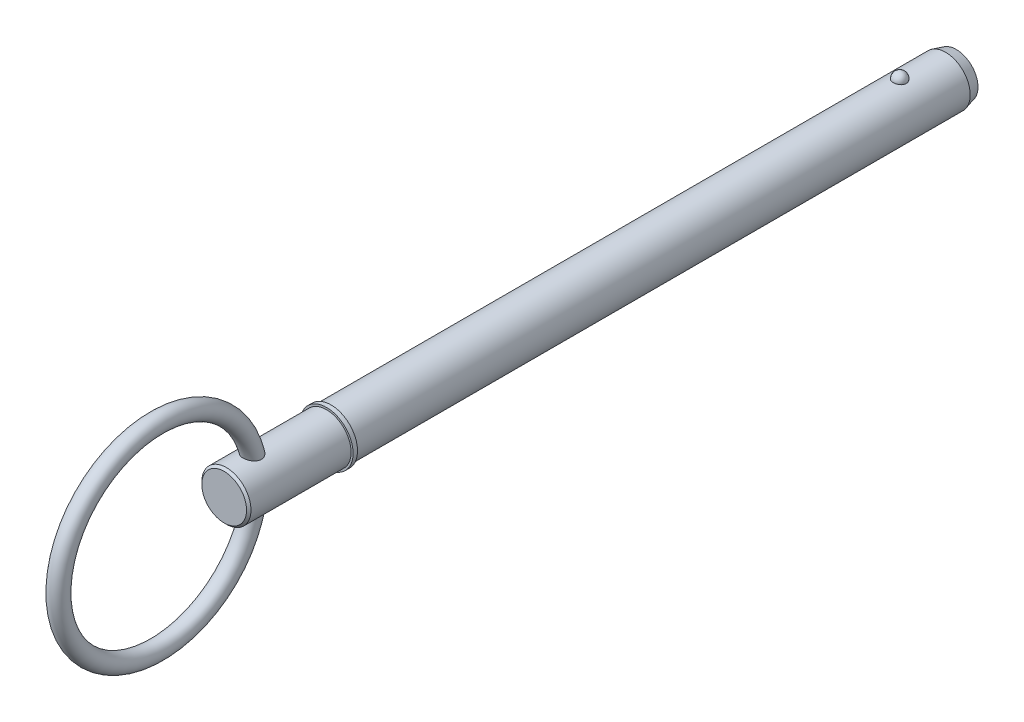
ISO-10303-21;
HEADER;
FILE_DESCRIPTION(('STEP AP214'),'2;1');
FILE_NAME('part.step','',(''),(''),'','','');
FILE_SCHEMA(('AUTOMOTIVE_DESIGN { 1 0 10303 214 1 1 1 1 }'));
ENDSEC;
DATA;
#1=APPLICATION_CONTEXT('core data for automotive mechanical design processes');
#2=APPLICATION_PROTOCOL_DEFINITION('international standard','automotive_design',2000,#1);
#3=PRODUCT_CONTEXT('',#1,'mechanical');
#4=PRODUCT('Part','Part','',(#3));
#5=PRODUCT_RELATED_PRODUCT_CATEGORY('part','',(#4));
#6=PRODUCT_DEFINITION_FORMATION('','',#4);
#7=PRODUCT_DEFINITION_CONTEXT('part definition',#1,'design');
#8=PRODUCT_DEFINITION('design','',#6,#7);
#9=PRODUCT_DEFINITION_SHAPE('','',#8);
#10=(LENGTH_UNIT() NAMED_UNIT(*) SI_UNIT(.MILLI.,.METRE.));
#11=(NAMED_UNIT(*) PLANE_ANGLE_UNIT() SI_UNIT($,.RADIAN.));
#12=(NAMED_UNIT(*) SI_UNIT($,.STERADIAN.) SOLID_ANGLE_UNIT());
#13=UNCERTAINTY_MEASURE_WITH_UNIT(LENGTH_MEASURE(1.E-05),#10,'distance_accuracy_value','');
#14=(GEOMETRIC_REPRESENTATION_CONTEXT(3) GLOBAL_UNCERTAINTY_ASSIGNED_CONTEXT((#13)) GLOBAL_UNIT_ASSIGNED_CONTEXT((#10,
#11,#12)) REPRESENTATION_CONTEXT('',''));
#15=CARTESIAN_POINT('',(0.,0.,0.));
#16=DIRECTION('',(0.,0.,1.));
#17=DIRECTION('',(1.,0.,0.));
#18=AXIS2_PLACEMENT_3D('',#15,#16,#17);
#19=CARTESIAN_POINT('',(0.,0.,127.));
#20=DIRECTION('',(0.,0.,-1.));
#21=DIRECTION('',(-1.,0.,0.));
#22=AXIS2_PLACEMENT_3D('',#19,#20,#21);
#23=CYLINDRICAL_SURFACE('',#22,5.555);
#24=CARTESIAN_POINT('',(1.47653932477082,5.35517101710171,-1.49));
#25=CARTESIAN_POINT('',(1.4765376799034,5.35517235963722,-1.40667872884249));
#26=CARTESIAN_POINT('',(1.4697233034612,5.35706459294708,-1.32333626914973));
#27=CARTESIAN_POINT('',(1.4426291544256,5.36442332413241,-1.15900769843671));
#28=CARTESIAN_POINT('',(1.42234344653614,5.36989139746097,-1.07802264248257));
#29=CARTESIAN_POINT('',(1.36882802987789,5.38378061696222,-0.920757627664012));
#30=CARTESIAN_POINT('',(1.33560404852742,5.39220045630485,-0.844475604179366));
#31=CARTESIAN_POINT('',(1.25704906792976,5.41105136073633,-0.698703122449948));
#32=CARTESIAN_POINT('',(1.21171855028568,5.42148234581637,-0.629212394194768));
#33=CARTESIAN_POINT('',(1.10986325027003,5.44324765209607,-0.498626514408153));
#34=CARTESIAN_POINT('',(1.05328868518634,5.45458585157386,-0.437570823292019));
#35=CARTESIAN_POINT('',(0.930545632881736,5.4768596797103,-0.325918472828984));
#36=CARTESIAN_POINT('',(0.864377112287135,5.48779530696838,-0.275321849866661));
#37=CARTESIAN_POINT('',(0.724412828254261,5.50801510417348,-0.186125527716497));
#38=CARTESIAN_POINT('',(0.650637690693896,5.51730356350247,-0.147494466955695));
#39=CARTESIAN_POINT('',(0.497383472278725,5.53322345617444,-0.0831582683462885));
#40=CARTESIAN_POINT('',(0.417904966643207,5.53985515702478,-0.0574518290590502));
#41=CARTESIAN_POINT('',(0.256903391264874,5.54963245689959,-0.0200294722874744));
#42=CARTESIAN_POINT('',(0.17543580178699,5.55283384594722,-0.00808940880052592));
#43=CARTESIAN_POINT('',(0.011588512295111,5.55559187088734,0.00221439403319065));
#44=CARTESIAN_POINT('',(-0.0707911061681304,5.55514883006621,0.000579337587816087));
#45=CARTESIAN_POINT('',(-0.232980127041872,5.55069756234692,-0.0161051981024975));
#46=CARTESIAN_POINT('',(-0.312809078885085,5.54673626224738,-0.0309781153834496));
#47=CARTESIAN_POINT('',(-0.468771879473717,5.5357377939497,-0.0734743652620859));
#48=CARTESIAN_POINT('',(-0.544905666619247,5.52870057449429,-0.101097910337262));
#49=CARTESIAN_POINT('',(-0.691800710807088,5.51225307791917,-0.168516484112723));
#50=CARTESIAN_POINT('',(-0.762530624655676,5.50283015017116,-0.2083766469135));
#51=CARTESIAN_POINT('',(-0.896294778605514,5.48263289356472,-0.299136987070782));
#52=CARTESIAN_POINT('',(-0.959328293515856,5.47185843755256,-0.350038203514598));
#53=CARTESIAN_POINT('',(-1.07712789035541,5.44990641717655,-0.462517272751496));
#54=CARTESIAN_POINT('',(-1.13172901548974,5.43872509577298,-0.524267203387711));
#55=CARTESIAN_POINT('',(-1.2299173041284,5.41736658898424,-0.656133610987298));
#56=CARTESIAN_POINT('',(-1.2735037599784,5.40718946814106,-0.726250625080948));
#57=CARTESIAN_POINT('',(-1.34896420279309,5.38886361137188,-0.873713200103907));
#58=CARTESIAN_POINT('',(-1.38071142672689,5.38073711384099,-0.951126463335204));
#59=CARTESIAN_POINT('',(-1.4310375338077,5.36757288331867,-1.11037033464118));
#60=CARTESIAN_POINT('',(-1.44961676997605,5.3625350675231,-1.19220082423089));
#61=CARTESIAN_POINT('',(-1.47308754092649,5.35613553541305,-1.35761209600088));
#62=CARTESIAN_POINT('',(-1.47803294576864,5.35475935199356,-1.44118467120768));
#63=CARTESIAN_POINT('',(-1.47426441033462,5.35579807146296,-1.6079958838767));
#64=CARTESIAN_POINT('',(-1.46555080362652,5.35821288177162,-1.69123452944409));
#65=CARTESIAN_POINT('',(-1.43475662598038,5.36653964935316,-1.8546288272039));
#66=CARTESIAN_POINT('',(-1.41273621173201,5.37243586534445,-1.93479663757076));
#67=CARTESIAN_POINT('',(-1.35593151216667,5.38705199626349,-2.09020110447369));
#68=CARTESIAN_POINT('',(-1.32114675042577,5.39577201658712,-2.16543757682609));
#69=CARTESIAN_POINT('',(-1.23947506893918,5.41511674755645,-2.30926926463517));
#70=CARTESIAN_POINT('',(-1.1925277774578,5.42575087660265,-2.37782893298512));
#71=CARTESIAN_POINT('',(-1.08780725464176,5.44771095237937,-2.50598876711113));
#72=CARTESIAN_POINT('',(-1.03003365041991,5.4590369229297,-2.56558862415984));
#73=CARTESIAN_POINT('',(-0.90495349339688,5.48116073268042,-2.67436535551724));
#74=CARTESIAN_POINT('',(-0.837616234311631,5.49195671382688,-2.7235073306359));
#75=CARTESIAN_POINT('',(-0.69537970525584,5.51177099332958,-2.8097317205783));
#76=CARTESIAN_POINT('',(-0.620480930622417,5.52078940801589,-2.84681492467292));
#77=CARTESIAN_POINT('',(-0.466144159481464,5.53594369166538,-2.90749751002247));
#78=CARTESIAN_POINT('',(-0.386768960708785,5.54211181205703,-2.93124844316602));
#79=CARTESIAN_POINT('',(-0.224991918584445,5.5510324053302,-2.96523308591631));
#80=CARTESIAN_POINT('',(-0.142590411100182,5.55378525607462,-2.97546829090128));
#81=CARTESIAN_POINT('',(0.0213711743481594,5.55555351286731,-2.98206550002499));
#82=CARTESIAN_POINT('',(0.102921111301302,5.55463281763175,-2.97866468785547));
#83=CARTESIAN_POINT('',(0.2642564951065,5.54929804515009,-2.95862186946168));
#84=CARTESIAN_POINT('',(0.344041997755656,5.54488407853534,-2.94198028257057));
#85=CARTESIAN_POINT('',(0.499344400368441,5.53305794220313,-2.89600357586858));
#86=CARTESIAN_POINT('',(0.574874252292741,5.52565550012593,-2.86670961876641));
#87=CARTESIAN_POINT('',(0.71989857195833,5.50863937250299,-2.79624249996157));
#88=CARTESIAN_POINT('',(0.78939269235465,5.49902555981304,-2.75506865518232));
#89=CARTESIAN_POINT('',(0.921480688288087,5.47845199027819,-2.66127110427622));
#90=CARTESIAN_POINT('',(0.983960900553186,5.46747485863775,-2.60849118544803));
#91=CARTESIAN_POINT('',(1.09925057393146,5.44546837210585,-2.49325304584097));
#92=CARTESIAN_POINT('',(1.15205830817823,5.43443900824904,-2.43079310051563));
#93=CARTESIAN_POINT('',(1.24742943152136,5.41335152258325,-2.29680711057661));
#94=CARTESIAN_POINT('',(1.28981661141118,5.40331162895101,-2.22515272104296));
#95=CARTESIAN_POINT('',(1.36214937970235,5.38553336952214,-2.07558035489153));
#96=CARTESIAN_POINT('',(1.39210034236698,5.37779400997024,-1.99766510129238));
#97=CARTESIAN_POINT('',(1.43569518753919,5.36630594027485,-1.84848338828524));
#98=CARTESIAN_POINT('',(1.45098536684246,5.36216169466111,-1.77772322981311));
#99=CARTESIAN_POINT('',(1.47140805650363,5.35659367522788,-1.63464735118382));
#100=CARTESIAN_POINT('',(1.47654075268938,5.35516985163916,-1.5623316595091));
#101=CARTESIAN_POINT('',(1.47653932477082,5.35517101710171,-1.49));
#102=B_SPLINE_CURVE_WITH_KNOTS('',3,(#24,#25,#26,#27,#28,#29,#30,#31,#32,#33,#34,#35,#36,#37,
#38,#39,#40,#41,#42,#43,#44,#45,#46,#47,#48,#49,#50,#51,#52,#53,#54,#55,#56,#57,#58,#59,#60,#61,
#62,#63,#64,#65,#66,#67,#68,#69,#70,#71,#72,#73,#74,#75,#76,#77,#78,#79,#80,#81,#82,#83,#84,#85,
#86,#87,#88,#89,#90,#91,#92,#93,#94,#95,#96,#97,#98,#99,#100,#101),.UNSPECIFIED.,.T.,.F.,(4,2,2,
2,2,2,2,2,2,2,2,2,2,2,2,2,2,2,2,2,2,2,2,2,2,2,2,2,2,2,2,2,2,2,2,2,2,2,4),(0.,0.249703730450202,
0.4995175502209,0.749220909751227,0.998914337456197,1.24973894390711,1.50056442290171,
1.75072681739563,2.00086401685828,2.24686822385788,2.49285060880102,2.73560052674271,
2.97835449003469,3.22242369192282,3.46651587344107,3.71490232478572,3.96330473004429,
4.21429522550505,4.46527899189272,4.71526963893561,4.96525418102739,5.21411697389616,
5.46298905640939,5.71312097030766,5.96326150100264,6.21422412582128,6.46517032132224,
6.71320296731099,6.96120816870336,7.20491846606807,7.44862104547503,7.69153667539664,
7.93446627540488,8.18089104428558,8.42735976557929,8.67774679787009,8.92802551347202,
9.14479867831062,9.36156787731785),.UNSPECIFIED.);
#103=CARTESIAN_POINT('',(1.47653932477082,5.35517101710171,-1.49));
#104=VERTEX_POINT('',#103);
#105=EDGE_CURVE('E103',#104,#104,#102,.T.);
#106=ORIENTED_EDGE('',*,*,#105,.T.);
#107=EDGE_LOOP('',(#106));
#108=FACE_BOUND('',#107,.T.);
#109=CARTESIAN_POINT('',(0.,0.,-11.87));
#110=DIRECTION('',(0.,0.,-1.));
#111=DIRECTION('',(-1.,0.,0.));
#112=AXIS2_PLACEMENT_3D('',#109,#110,#111);
#113=CIRCLE('',#112,5.555);
#114=CARTESIAN_POINT('',(5.555,0.,-11.87));
#115=VERTEX_POINT('',#114);
#116=EDGE_CURVE('E110',#115,#115,#113,.F.);
#117=ORIENTED_EDGE('',*,*,#116,.T.);
#118=EDGE_LOOP('',(#117));
#119=FACE_BOUND('',#118,.T.);
#120=CARTESIAN_POINT('',(0.,0.,127.));
#121=DIRECTION('',(0.,0.,1.));
#122=DIRECTION('',(1.,0.,0.));
#123=AXIS2_PLACEMENT_3D('',#120,#121,#122);
#124=CIRCLE('',#123,5.555);
#125=CARTESIAN_POINT('',(5.555,0.,127.));
#126=VERTEX_POINT('',#125);
#127=EDGE_CURVE('E108',#126,#126,#124,.T.);
#128=ORIENTED_EDGE('',*,*,#127,.F.);
#129=EDGE_LOOP('',(#128));
#130=FACE_BOUND('',#129,.T.);
#131=ADVANCED_FACE('F39',(#108,#119,#130),#23,.T.);
#132=CARTESIAN_POINT('',(0.,0.,-14.27));
#133=DIRECTION('',(0.,0.,-1.));
#134=DIRECTION('',(-1.,0.,0.));
#135=AXIS2_PLACEMENT_3D('',#132,#133,#134);
#136=PLANE('',#135);
#137=CARTESIAN_POINT('',(0.,0.,-14.27));
#138=DIRECTION('',(0.,0.,-1.));
#139=DIRECTION('',(-1.,0.,0.));
#140=AXIS2_PLACEMENT_3D('',#137,#138,#139);
#141=CIRCLE('',#140,4.9119219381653);
#142=CARTESIAN_POINT('',(4.9119219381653,0.,-14.27));
#143=VERTEX_POINT('',#142);
#144=EDGE_CURVE('E141',#143,#143,#141,.T.);
#145=ORIENTED_EDGE('',*,*,#144,.T.);
#146=EDGE_LOOP('',(#145));
#147=FACE_BOUND('',#146,.T.);
#148=ADVANCED_FACE('F89',(#147),#136,.T.);
#149=CARTESIAN_POINT('',(0.,0.,-14.27));
#150=DIRECTION('',(0.,0.,1.));
#151=DIRECTION('',(1.,0.,0.));
#152=AXIS2_PLACEMENT_3D('',#149,#150,#151);
#153=CONICAL_SURFACE('',#152,4.9119219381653,0.261799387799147);
#154=CARTESIAN_POINT('',(5.555,0.,-11.87));
#155=CARTESIAN_POINT('',(5.54830127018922,0.,-11.895));
#156=CARTESIAN_POINT('',(5.54160254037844,0.,-11.92));
#157=CARTESIAN_POINT('',(5.52820508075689,0.,-11.97));
#158=CARTESIAN_POINT('',(5.52150635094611,0.,-11.995));
#159=CARTESIAN_POINT('',(5.50810889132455,0.,-12.045));
#160=CARTESIAN_POINT('',(5.50141016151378,0.,-12.07));
#161=CARTESIAN_POINT('',(5.48801270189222,0.,-12.12));
#162=CARTESIAN_POINT('',(5.48131397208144,0.,-12.145));
#163=CARTESIAN_POINT('',(5.46791651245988,0.,-12.195));
#164=CARTESIAN_POINT('',(5.46121778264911,0.,-12.22));
#165=CARTESIAN_POINT('',(5.44782032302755,0.,-12.27));
#166=CARTESIAN_POINT('',(5.44112159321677,0.,-12.295));
#167=CARTESIAN_POINT('',(5.42772413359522,0.,-12.345));
#168=CARTESIAN_POINT('',(5.42102540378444,0.,-12.37));
#169=CARTESIAN_POINT('',(5.40762794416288,0.,-12.42));
#170=CARTESIAN_POINT('',(5.4009292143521,0.,-12.445));
#171=CARTESIAN_POINT('',(5.38753175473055,0.,-12.495));
#172=CARTESIAN_POINT('',(5.38083302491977,0.,-12.52));
#173=CARTESIAN_POINT('',(5.36743556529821,0.,-12.57));
#174=CARTESIAN_POINT('',(5.36073683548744,0.,-12.595));
#175=CARTESIAN_POINT('',(5.34733937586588,0.,-12.645));
#176=CARTESIAN_POINT('',(5.3406406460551,0.,-12.67));
#177=CARTESIAN_POINT('',(5.32724318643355,0.,-12.72));
#178=CARTESIAN_POINT('',(5.32054445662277,0.,-12.745));
#179=CARTESIAN_POINT('',(5.30714699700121,0.,-12.795));
#180=CARTESIAN_POINT('',(5.30044826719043,0.,-12.82));
#181=CARTESIAN_POINT('',(5.28705080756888,0.,-12.87));
#182=CARTESIAN_POINT('',(5.2803520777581,0.,-12.895));
#183=CARTESIAN_POINT('',(5.26695461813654,0.,-12.945));
#184=CARTESIAN_POINT('',(5.26025588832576,0.,-12.97));
#185=CARTESIAN_POINT('',(5.24685842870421,0.,-13.02));
#186=CARTESIAN_POINT('',(5.24015969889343,0.,-13.045));
#187=CARTESIAN_POINT('',(5.22676223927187,0.,-13.095));
#188=CARTESIAN_POINT('',(5.2200635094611,0.,-13.12));
#189=CARTESIAN_POINT('',(5.20666604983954,0.,-13.17));
#190=CARTESIAN_POINT('',(5.19996732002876,0.,-13.195));
#191=CARTESIAN_POINT('',(5.18656986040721,0.,-13.245));
#192=CARTESIAN_POINT('',(5.17987113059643,0.,-13.27));
#193=CARTESIAN_POINT('',(5.16647367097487,0.,-13.32));
#194=CARTESIAN_POINT('',(5.15977494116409,0.,-13.345));
#195=CARTESIAN_POINT('',(5.14637748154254,0.,-13.395));
#196=CARTESIAN_POINT('',(5.13967875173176,0.,-13.42));
#197=CARTESIAN_POINT('',(5.1262812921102,0.,-13.47));
#198=CARTESIAN_POINT('',(5.11958256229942,0.,-13.495));
#199=CARTESIAN_POINT('',(5.10618510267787,0.,-13.545));
#200=CARTESIAN_POINT('',(5.09948637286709,0.,-13.57));
#201=CARTESIAN_POINT('',(5.08608891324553,0.,-13.62));
#202=CARTESIAN_POINT('',(5.07939018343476,0.,-13.645));
#203=CARTESIAN_POINT('',(5.0659927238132,0.,-13.695));
#204=CARTESIAN_POINT('',(5.05929399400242,0.,-13.72));
#205=CARTESIAN_POINT('',(5.04589653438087,0.,-13.77));
#206=CARTESIAN_POINT('',(5.03919780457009,0.,-13.795));
#207=CARTESIAN_POINT('',(5.02580034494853,0.,-13.845));
#208=CARTESIAN_POINT('',(5.01910161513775,0.,-13.87));
#209=CARTESIAN_POINT('',(5.0057041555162,0.,-13.92));
#210=CARTESIAN_POINT('',(4.99900542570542,0.,-13.945));
#211=CARTESIAN_POINT('',(4.98560796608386,0.,-13.995));
#212=CARTESIAN_POINT('',(4.97890923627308,0.,-14.02));
#213=CARTESIAN_POINT('',(4.96551177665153,0.,-14.07));
#214=CARTESIAN_POINT('',(4.95881304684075,0.,-14.095));
#215=CARTESIAN_POINT('',(4.94541558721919,0.,-14.145));
#216=CARTESIAN_POINT('',(4.93871685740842,0.,-14.17));
#217=CARTESIAN_POINT('',(4.92531939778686,0.,-14.22));
#218=CARTESIAN_POINT('',(4.91862066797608,0.,-14.245));
#219=CARTESIAN_POINT('',(4.9119219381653,0.,-14.27));
#220=B_SPLINE_CURVE_WITH_KNOTS('',3,(#154,#155,#156,#157,#158,#159,#160,#161,#162,#163,#164,
#165,#166,#167,#168,#169,#170,#171,#172,#173,#174,#175,#176,#177,#178,#179,#180,#181,#182,#183,
#184,#185,#186,#187,#188,#189,#190,#191,#192,#193,#194,#195,#196,#197,#198,#199,#200,#201,#202,
#203,#204,#205,#206,#207,#208,#209,#210,#211,#212,#213,#214,#215,#216,#217,#218,#219),
.UNSPECIFIED.,.F.,.F.,(4,2,2,2,2,2,2,2,2,2,2,2,2,2,2,2,2,2,2,2,2,2,2,2,2,2,2,2,2,2,2,2,4),(0.,
0.0776457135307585,0.155291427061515,0.232937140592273,0.31058285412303,0.388228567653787,
0.465874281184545,0.543519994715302,0.621165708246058,0.698811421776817,0.776457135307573,
0.854102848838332,0.931748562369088,1.00939427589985,1.0870399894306,1.16468570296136,
1.24233141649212,1.31997713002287,1.39762284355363,1.47526855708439,1.55291427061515,
1.6305599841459,1.70820569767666,1.78585141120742,1.86349712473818,1.94114283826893,
2.01878855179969,2.09643426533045,2.17407997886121,2.25172569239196,2.32937140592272,
2.40701711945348,2.48466283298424),.UNSPECIFIED.);
#221=EDGE_CURVE('BSEAM95',#115,#143,#220,.T.);
#222=ORIENTED_EDGE('',*,*,#116,.F.);
#223=ORIENTED_EDGE('',*,*,#144,.F.);
#224=ORIENTED_EDGE('',*,*,#221,.T.);
#225=ORIENTED_EDGE('',*,*,#221,.F.);
#226=EDGE_LOOP('',(#222,#224,#223,#225));
#227=FACE_BOUND('',#226,.T.);
#228=ADVANCED_FACE('F95',(#227),#153,.T.);
#229=CARTESIAN_POINT('',(0.,5.555,-1.49));
#230=DIRECTION('',(0.,1.,0.));
#231=DIRECTION('',(0.,0.,-1.));
#232=AXIS2_PLACEMENT_3D('',#229,#230,#231);
#233=SPHERICAL_SURFACE('',#232,1.49);
#234=ORIENTED_EDGE('',*,*,#105,.F.);
#235=EDGE_LOOP('',(#234));
#236=FACE_BOUND('',#235,.T.);
#237=ADVANCED_FACE('F113',(#236),#233,.T.);
#238=CARTESIAN_POINT('',(0.,0.,127.));
#239=DIRECTION('',(0.,0.,-1.));
#240=DIRECTION('',(-1.,0.,0.));
#241=AXIS2_PLACEMENT_3D('',#238,#239,#240);
#242=PLANE('',#241);
#243=ORIENTED_EDGE('',*,*,#127,.T.);
#244=EDGE_LOOP('',(#243));
#245=FACE_BOUND('',#244,.T.);
#246=CARTESIAN_POINT('',(0.,0.,127.));
#247=DIRECTION('',(0.,0.,-1.));
#248=DIRECTION('',(-1.,0.,0.));
#249=AXIS2_PLACEMENT_3D('',#246,#247,#248);
#250=CIRCLE('',#249,6.);
#251=CARTESIAN_POINT('',(-6.,0.,127.));
#252=VERTEX_POINT('',#251);
#253=EDGE_CURVE('E109',#252,#252,#250,.T.);
#254=ORIENTED_EDGE('',*,*,#253,.T.);
#255=EDGE_LOOP('',(#254));
#256=FACE_BOUND('',#255,.T.);
#257=ADVANCED_FACE('F117',(#245,#256),#242,.T.);
#258=CARTESIAN_POINT('',(0.,0.,33.7287874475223));
#259=DIRECTION('',(0.,0.,-1.));
#260=DIRECTION('',(-1.,0.,0.));
#261=AXIS2_PLACEMENT_3D('',#258,#259,#260);
#262=CYLINDRICAL_SURFACE('',#261,6.);
#263=CARTESIAN_POINT('',(0.,0.,128.));
#264=DIRECTION('',(0.,0.,-1.));
#265=DIRECTION('',(-1.,0.,0.));
#266=AXIS2_PLACEMENT_3D('',#263,#264,#265);
#267=CIRCLE('',#266,6.);
#268=CARTESIAN_POINT('',(-6.,0.,128.));
#269=VERTEX_POINT('',#268);
#270=EDGE_CURVE('E134',#269,#269,#267,.T.);
#271=ORIENTED_EDGE('',*,*,#270,.T.);
#272=EDGE_LOOP('',(#271));
#273=FACE_BOUND('',#272,.T.);
#274=ORIENTED_EDGE('',*,*,#253,.F.);
#275=EDGE_LOOP('',(#274));
#276=FACE_BOUND('',#275,.T.);
#277=ADVANCED_FACE('F121',(#273,#276),#262,.T.);
#278=CARTESIAN_POINT('',(0.,6.,128.));
#279=DIRECTION('',(0.,0.,1.));
#280=DIRECTION('',(1.,0.,0.));
#281=AXIS2_PLACEMENT_3D('',#278,#279,#280);
#282=PLANE('',#281);
#283=CARTESIAN_POINT('',(0.,0.,128.));
#284=DIRECTION('',(0.,0.,1.));
#285=DIRECTION('',(1.,0.,0.));
#286=AXIS2_PLACEMENT_3D('',#283,#284,#285);
#287=CIRCLE('',#286,5.555);
#288=CARTESIAN_POINT('',(5.555,0.,128.));
#289=VERTEX_POINT('',#288);
#290=EDGE_CURVE('E112',#289,#289,#287,.T.);
#291=ORIENTED_EDGE('',*,*,#290,.F.);
#292=EDGE_LOOP('',(#291));
#293=FACE_BOUND('',#292,.T.);
#294=ORIENTED_EDGE('',*,*,#270,.F.);
#295=EDGE_LOOP('',(#294));
#296=FACE_BOUND('',#295,.T.);
#297=ADVANCED_FACE('F86',(#293,#296),#282,.T.);
#298=CARTESIAN_POINT('',(0.,0.,151.13));
#299=DIRECTION('',(0.,0.,-1.));
#300=DIRECTION('',(-1.,0.,0.));
#301=AXIS2_PLACEMENT_3D('',#298,#299,#300);
#302=CYLINDRICAL_SURFACE('',#301,5.555);
#303=CARTESIAN_POINT('',(-0.961380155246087,-5.47117658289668,143.008733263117));
#304=CARTESIAN_POINT('',(-0.863231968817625,-5.4884217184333,142.957515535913));
#305=CARTESIAN_POINT('',(-0.760548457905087,-5.50372118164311,142.914318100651));
#306=CARTESIAN_POINT('',(-0.548956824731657,-5.52883500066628,142.844912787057));
#307=CARTESIAN_POINT('',(-0.440048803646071,-5.53864944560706,142.818704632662));
#308=CARTESIAN_POINT('',(-0.219033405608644,-5.55178384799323,142.783864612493));
#309=CARTESIAN_POINT('',(-0.106925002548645,-5.55510169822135,142.775238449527));
#310=CARTESIAN_POINT('',(0.11723899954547,-5.55489351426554,142.775783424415));
#311=CARTESIAN_POINT('',(0.229294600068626,-5.55136768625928,142.784954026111));
#312=CARTESIAN_POINT('',(0.449588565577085,-5.5378711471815,142.820784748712));
#313=CARTESIAN_POINT('',(0.557843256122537,-5.52793284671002,142.847356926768));
#314=CARTESIAN_POINT('',(0.768116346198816,-5.50265785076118,142.917309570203));
#315=CARTESIAN_POINT('',(0.87013418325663,-5.48732066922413,142.960691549));
#316=CARTESIAN_POINT('',(1.06580880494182,-5.45270790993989,143.063685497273));
#317=CARTESIAN_POINT('',(1.15940337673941,-5.43340601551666,143.123406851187));
#318=CARTESIAN_POINT('',(1.33484934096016,-5.39298781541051,143.257672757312));
#319=CARTESIAN_POINT('',(1.41670019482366,-5.37187142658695,143.332217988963));
#320=CARTESIAN_POINT('',(1.56628651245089,-5.33017932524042,143.494433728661));
#321=CARTESIAN_POINT('',(1.63402728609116,-5.30960341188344,143.582099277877));
#322=CARTESIAN_POINT('',(1.75338323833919,-5.27139606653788,143.76835593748));
#323=CARTESIAN_POINT('',(1.80500413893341,-5.25376359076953,143.866943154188));
#324=CARTESIAN_POINT('',(1.88923054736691,-5.22405733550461,144.068866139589));
#325=CARTESIAN_POINT('',(1.92240068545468,-5.21182119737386,144.171942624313));
#326=CARTESIAN_POINT('',(1.97156802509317,-5.19342304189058,144.382612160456));
#327=CARTESIAN_POINT('',(1.98756752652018,-5.18726021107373,144.490204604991));
#328=CARTESIAN_POINT('',(2.00238957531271,-5.1815556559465,144.704813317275));
#329=CARTESIAN_POINT('',(2.0015062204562,-5.18190056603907,144.811807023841));
#330=CARTESIAN_POINT('',(1.98404322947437,-5.18861029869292,145.024294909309));
#331=CARTESIAN_POINT('',(1.96745884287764,-5.19497694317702,145.12978862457));
#332=CARTESIAN_POINT('',(1.91810947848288,-5.21340722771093,145.343734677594));
#333=CARTESIAN_POINT('',(1.88435438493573,-5.22581720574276,145.451927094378));
#334=CARTESIAN_POINT('',(1.80161540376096,-5.25491400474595,145.661718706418));
#335=CARTESIAN_POINT('',(1.7526231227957,-5.27160318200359,145.763314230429));
#336=CARTESIAN_POINT('',(1.63431251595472,-5.30955034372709,145.968856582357));
#337=CARTESIAN_POINT('',(1.5633341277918,-5.33111051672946,146.071796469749));
#338=CARTESIAN_POINT('',(1.4052960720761,-5.37493145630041,146.26447165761));
#339=CARTESIAN_POINT('',(1.31822569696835,-5.39719268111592,146.354198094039));
#340=CARTESIAN_POINT('',(1.12728892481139,-5.44031451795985,146.519004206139));
#341=CARTESIAN_POINT('',(1.02309899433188,-5.46113424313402,146.593723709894));
#342=CARTESIAN_POINT('',(0.801576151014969,-5.49800171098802,146.721805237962));
#343=CARTESIAN_POINT('',(0.684264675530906,-5.51405708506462,146.775201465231));
#344=CARTESIAN_POINT('',(0.45687763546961,-5.53719478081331,146.850980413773));
#345=CARTESIAN_POINT('',(0.34797457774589,-5.54519800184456,146.876584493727));
#346=CARTESIAN_POINT('',(0.127042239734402,-5.55464249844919,146.906731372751));
#347=CARTESIAN_POINT('',(0.0150164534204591,-5.55609083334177,146.911296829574));
#348=CARTESIAN_POINT('',(-0.19199318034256,-5.55250986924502,146.899911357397));
#349=CARTESIAN_POINT('',(-0.287160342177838,-5.54836194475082,146.886752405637));
#350=CARTESIAN_POINT('',(-0.473863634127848,-5.53554271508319,146.845489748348));
#351=CARTESIAN_POINT('',(-0.565399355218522,-5.52687090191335,146.817384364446));
#352=CARTESIAN_POINT('',(-0.743786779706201,-5.50572322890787,146.747293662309));
#353=CARTESIAN_POINT('',(-0.830566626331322,-5.49320168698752,146.705141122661));
#354=CARTESIAN_POINT('',(-0.996720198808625,-5.46549909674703,146.608875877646));
#355=CARTESIAN_POINT('',(-1.07609119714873,-5.45031707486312,146.554758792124));
#356=CARTESIAN_POINT('',(-1.23672272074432,-5.41628785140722,146.428211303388));
#357=CARTESIAN_POINT('',(-1.3167603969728,-5.39722327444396,146.35428911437));
#358=CARTESIAN_POINT('',(-1.46504263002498,-5.3588760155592,146.195462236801));
#359=CARTESIAN_POINT('',(-1.5332782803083,-5.33959318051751,146.110549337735));
#360=CARTESIAN_POINT('',(-1.66602271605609,-5.29979878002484,145.918697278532));
#361=CARTESIAN_POINT('',(-1.72857256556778,-5.27951148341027,145.810347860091));
#362=CARTESIAN_POINT('',(-1.83559571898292,-5.24326402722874,145.584325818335));
#363=CARTESIAN_POINT('',(-1.88006296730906,-5.22730531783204,145.466650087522));
#364=CARTESIAN_POINT('',(-1.94988009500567,-5.20167534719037,145.222087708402));
#365=CARTESIAN_POINT('',(-1.97477410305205,-5.19215470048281,145.09505279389));
#366=CARTESIAN_POINT('',(-2.00168294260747,-5.18184594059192,144.838249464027));
#367=CARTESIAN_POINT('',(-2.00372217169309,-5.18104851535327,144.70848411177));
#368=CARTESIAN_POINT('',(-1.98467753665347,-5.18836681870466,144.464652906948));
#369=CARTESIAN_POINT('',(-1.96600067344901,-5.19555485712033,144.350370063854));
#370=CARTESIAN_POINT('',(-1.90923541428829,-5.21668050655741,144.127389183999));
#371=CARTESIAN_POINT('',(-1.87115335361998,-5.23061591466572,144.018689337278));
#372=CARTESIAN_POINT('',(-1.78015350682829,-5.26224244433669,143.818371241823));
#373=CARTESIAN_POINT('',(-1.72857344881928,-5.27957041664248,143.72608293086));
#374=CARTESIAN_POINT('',(-1.61106729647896,-5.31660340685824,143.551684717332));
#375=CARTESIAN_POINT('',(-1.54514024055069,-5.33630858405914,143.469575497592));
#376=CARTESIAN_POINT('',(-1.39929408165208,-5.37641320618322,143.315887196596));
#377=CARTESIAN_POINT('',(-1.31912544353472,-5.39681868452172,143.244546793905));
#378=CARTESIAN_POINT('',(-1.14786008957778,-5.43582099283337,143.115855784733));
#379=CARTESIAN_POINT('',(-1.05676174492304,-5.4544175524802,143.058507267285));
#380=CARTESIAN_POINT('',(-0.961380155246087,-5.47117658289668,143.008733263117));
#381=B_SPLINE_CURVE_WITH_KNOTS('',3,(#303,#304,#305,#306,#307,#308,#309,#310,#311,#312,#313,
#314,#315,#316,#317,#318,#319,#320,#321,#322,#323,#324,#325,#326,#327,#328,#329,#330,#331,#332,
#333,#334,#335,#336,#337,#338,#339,#340,#341,#342,#343,#344,#345,#346,#347,#348,#349,#350,#351,
#352,#353,#354,#355,#356,#357,#358,#359,#360,#361,#362,#363,#364,#365,#366,#367,#368,#369,#370,
#371,#372,#373,#374,#375,#376,#377,#378,#379,#380),.UNSPECIFIED.,.T.,.F.,(4,2,2,2,2,2,2,2,2,2,2,
2,2,2,2,2,2,2,2,2,2,2,2,2,2,2,2,2,2,2,2,2,2,2,2,2,2,2,4),(0.,0.335747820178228,
0.671490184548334,1.00734143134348,1.34318256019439,1.67733940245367,2.01152633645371,
2.34800767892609,2.6845044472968,3.02087435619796,3.35712472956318,3.68242216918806,
4.00767603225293,4.32726924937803,4.6469591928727,4.98762165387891,5.32847210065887,
5.7074287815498,6.08663853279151,6.47407889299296,6.86089527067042,7.19531213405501,
7.52936875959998,7.81649827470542,8.10366003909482,8.39437023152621,8.68518702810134,
9.01572837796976,9.34651809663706,9.72504519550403,10.1036989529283,10.4909301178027,
10.8777478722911,11.2239231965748,11.5699855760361,11.8899109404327,12.2098577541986,
12.5360928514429,12.8623766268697),.UNSPECIFIED.);
#382=CARTESIAN_POINT('',(-0.961380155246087,-5.47117658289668,143.008733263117));
#383=VERTEX_POINT('',#382);
#384=EDGE_CURVE('E10',#383,#383,#381,.T.);
#385=ORIENTED_EDGE('',*,*,#384,.F.);
#386=EDGE_LOOP('',(#385));
#387=FACE_BOUND('',#386,.T.);
#388=CARTESIAN_POINT('',(-0.961380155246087,5.47117658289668,143.008733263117));
#389=CARTESIAN_POINT('',(-1.05891474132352,5.45403910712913,143.059631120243));
#390=CARTESIAN_POINT('',(-1.15197270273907,5.43497920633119,143.118451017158));
#391=CARTESIAN_POINT('',(-1.32661268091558,5.39501222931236,143.25070162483));
#392=CARTESIAN_POINT('',(-1.40819495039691,5.37410519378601,143.324132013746));
#393=CARTESIAN_POINT('',(-1.55769110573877,5.33269731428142,143.484098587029));
#394=CARTESIAN_POINT('',(-1.62558729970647,5.31219702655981,143.570651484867));
#395=CARTESIAN_POINT('',(-1.74556031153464,5.2739951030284,143.754646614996));
#396=CARTESIAN_POINT('',(-1.7976419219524,5.25629262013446,143.852085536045));
#397=CARTESIAN_POINT('',(-1.88339939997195,5.22617061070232,144.052565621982));
#398=CARTESIAN_POINT('',(-1.91750373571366,5.21362983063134,144.155405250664));
#399=CARTESIAN_POINT('',(-1.96852412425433,5.194582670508,144.365778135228));
#400=CARTESIAN_POINT('',(-1.98544249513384,5.18807547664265,144.473310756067));
#401=CARTESIAN_POINT('',(-2.00201964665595,5.18170011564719,144.687819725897));
#402=CARTESIAN_POINT('',(-2.00199605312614,5.18170977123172,144.794768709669));
#403=CARTESIAN_POINT('',(-1.98621575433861,5.18777751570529,145.007306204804));
#404=CARTESIAN_POINT('',(-1.97045441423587,5.19383738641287,145.112894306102));
#405=CARTESIAN_POINT('',(-1.92280904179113,5.21167084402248,145.326914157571));
#406=CARTESIAN_POINT('',(-1.88996782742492,5.22378174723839,145.435103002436));
#407=CARTESIAN_POINT('',(-1.80906901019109,5.25234475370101,145.645029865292));
#408=CARTESIAN_POINT('',(-1.76100319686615,5.26879919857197,145.746764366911));
#409=CARTESIAN_POINT('',(-1.64464870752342,5.30634509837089,145.952788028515));
#410=CARTESIAN_POINT('',(-1.57469702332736,5.32774959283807,146.056085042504));
#411=CARTESIAN_POINT('',(-1.41872356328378,5.37138743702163,146.249688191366));
#412=CARTESIAN_POINT('',(-1.3326906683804,5.39362135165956,146.339985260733));
#413=CARTESIAN_POINT('',(-1.14345202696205,5.43692909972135,146.506557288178));
#414=CARTESIAN_POINT('',(-1.03986000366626,5.45795811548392,146.582409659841));
#415=CARTESIAN_POINT('',(-0.819338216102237,5.49537389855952,146.712916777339));
#416=CARTESIAN_POINT('',(-0.702429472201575,5.51176784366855,146.767604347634));
#417=CARTESIAN_POINT('',(-0.475167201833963,5.53565843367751,146.84602203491));
#418=CARTESIAN_POINT('',(-0.365997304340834,5.5440461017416,146.872893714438));
#419=CARTESIAN_POINT('',(-0.144272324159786,5.55422966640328,146.905426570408));
#420=CARTESIAN_POINT('',(-0.0317212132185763,5.55603301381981,146.911111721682));
#421=CARTESIAN_POINT('',(0.176166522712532,5.55303883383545,146.901592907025));
#422=CARTESIAN_POINT('',(0.271662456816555,5.54914868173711,146.889260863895));
#423=CARTESIAN_POINT('',(0.45914083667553,5.53678955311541,146.849523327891));
#424=CARTESIAN_POINT('',(0.5511229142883,5.52832009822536,146.822116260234));
#425=CARTESIAN_POINT('',(0.730082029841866,5.50755841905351,146.753437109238));
#426=CARTESIAN_POINT('',(0.817013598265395,5.49523641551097,146.712056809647));
#427=CARTESIAN_POINT('',(0.983569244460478,5.46788364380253,146.617293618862));
#428=CARTESIAN_POINT('',(1.0631907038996,5.45285191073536,146.563906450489));
#429=CARTESIAN_POINT('',(1.22430017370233,5.4191117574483,146.438982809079));
#430=CARTESIAN_POINT('',(1.30459540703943,5.40018081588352,146.365970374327));
#431=CARTESIAN_POINT('',(1.45353150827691,5.3620139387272,146.208943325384));
#432=CARTESIAN_POINT('',(1.52216366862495,5.3427777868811,146.124920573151));
#433=CARTESIAN_POINT('',(1.65601602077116,5.30294271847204,145.934811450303));
#434=CARTESIAN_POINT('',(1.71927851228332,5.28255425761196,145.827294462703));
#435=CARTESIAN_POINT('',(1.82790996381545,5.24595721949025,145.602847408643));
#436=CARTESIAN_POINT('',(1.8732722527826,5.22975020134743,145.485913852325));
#437=CARTESIAN_POINT('',(1.94526503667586,5.20341207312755,145.242194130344));
#438=CARTESIAN_POINT('',(1.97135787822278,5.1934564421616,145.11522738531));
#439=CARTESIAN_POINT('',(2.00068973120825,5.18223330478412,144.858318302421));
#440=CARTESIAN_POINT('',(2.00395290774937,5.18095661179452,144.728379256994));
#441=CARTESIAN_POINT('',(1.98717985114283,5.1874070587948,144.483763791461));
#442=CARTESIAN_POINT('',(1.96951989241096,5.19421607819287,144.368899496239));
#443=CARTESIAN_POINT('',(1.91463360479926,5.2146960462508,144.144589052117));
#444=CARTESIAN_POINT('',(1.87741409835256,5.22836460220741,144.035141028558));
#445=CARTESIAN_POINT('',(1.78800305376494,5.25957304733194,143.833542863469));
#446=CARTESIAN_POINT('',(1.73720600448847,5.27672774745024,143.740709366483));
#447=CARTESIAN_POINT('',(1.62116201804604,5.3135255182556,143.565121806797));
#448=CARTESIAN_POINT('',(1.55591428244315,5.33316872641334,143.482368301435));
#449=CARTESIAN_POINT('',(1.41164041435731,5.37317145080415,143.327648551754));
#450=CARTESIAN_POINT('',(1.3324195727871,5.39353732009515,143.255865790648));
#451=CARTESIAN_POINT('',(1.16300716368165,5.43258596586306,143.126112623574));
#452=CARTESIAN_POINT('',(1.07281393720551,5.45126848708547,143.068144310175));
#453=CARTESIAN_POINT('',(0.880638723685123,5.48564753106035,142.965507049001));
#454=CARTESIAN_POINT('',(0.778364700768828,5.50122427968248,142.921343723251));
#455=CARTESIAN_POINT('',(0.567418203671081,5.52696543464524,142.849973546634));
#456=CARTESIAN_POINT('',(0.458745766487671,5.53712987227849,142.822766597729));
#457=CARTESIAN_POINT('',(0.237791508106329,5.55101406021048,142.785879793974));
#458=CARTESIAN_POINT('',(0.125501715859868,5.55471842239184,142.77624178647));
#459=CARTESIAN_POINT('',(-0.0992056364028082,5.55525045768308,142.774849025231));
#460=CARTESIAN_POINT('',(-0.211623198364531,5.55207802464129,142.783094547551));
#461=CARTESIAN_POINT('',(-0.434217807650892,5.53913427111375,142.817408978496));
#462=CARTESIAN_POINT('',(-0.544370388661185,5.5293114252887,142.843617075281));
#463=CARTESIAN_POINT('',(-0.758352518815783,5.50404767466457,142.913395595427));
#464=CARTESIAN_POINT('',(-0.862181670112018,5.48860641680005,142.956967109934));
#465=CARTESIAN_POINT('',(-0.961380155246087,5.47117658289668,143.008733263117));
#466=B_SPLINE_CURVE_WITH_KNOTS('',3,(#388,#389,#390,#391,#392,#393,#394,#395,#396,#397,#398,
#399,#400,#401,#402,#403,#404,#405,#406,#407,#408,#409,#410,#411,#412,#413,#414,#415,#416,#417,
#418,#419,#420,#421,#422,#423,#424,#425,#426,#427,#428,#429,#430,#431,#432,#433,#434,#435,#436,
#437,#438,#439,#440,#441,#442,#443,#444,#445,#446,#447,#448,#449,#450,#451,#452,#453,#454,#455,
#456,#457,#458,#459,#460,#461,#462,#463,#464,#465),.UNSPECIFIED.,.T.,.F.,(4,2,2,2,2,2,2,2,2,2,2,
2,2,2,2,2,2,2,2,2,2,2,2,2,2,2,2,2,2,2,2,2,2,2,2,2,2,2,4),(0.,0.333636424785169,
0.667265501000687,1.00132312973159,1.3352794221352,1.6608682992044,1.98641325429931,
2.30585509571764,2.62539104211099,2.96514840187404,3.3050893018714,3.68313901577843,
4.06145109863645,4.44953802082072,4.83702062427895,5.17316628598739,5.50893144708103,
5.79666415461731,6.08442692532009,6.3744714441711,6.66461944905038,6.99384361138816,
7.32331250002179,7.70083591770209,8.07849989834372,8.46633986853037,8.85376924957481,
9.20110411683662,9.54831791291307,9.86844524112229,10.1885902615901,10.5136110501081,
10.8386810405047,11.1745469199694,11.5104108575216,11.847073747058,12.183741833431,
12.5230486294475,12.8623767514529),.UNSPECIFIED.);
#467=CARTESIAN_POINT('',(-0.961380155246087,5.47117658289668,143.008733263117));
#468=VERTEX_POINT('',#467);
#469=EDGE_CURVE('E51',#468,#468,#466,.T.);
#470=ORIENTED_EDGE('',*,*,#469,.F.);
#471=EDGE_LOOP('',(#470));
#472=FACE_BOUND('',#471,.T.);
#473=CARTESIAN_POINT('',(0.,0.,150.63));
#474=DIRECTION('',(0.,0.,-1.));
#475=DIRECTION('',(-1.,0.,0.));
#476=AXIS2_PLACEMENT_3D('',#473,#474,#475);
#477=CIRCLE('',#476,5.555);
#478=CARTESIAN_POINT('',(-5.555,0.,150.63));
#479=VERTEX_POINT('',#478);
#480=EDGE_CURVE('E65',#479,#479,#477,.T.);
#481=ORIENTED_EDGE('',*,*,#480,.T.);
#482=EDGE_LOOP('',(#481));
#483=FACE_BOUND('',#482,.T.);
#484=ORIENTED_EDGE('',*,*,#290,.T.);
#485=EDGE_LOOP('',(#484));
#486=FACE_BOUND('',#485,.T.);
#487=ADVANCED_FACE('F70',(#387,#472,#483,#486),#302,.T.);
#488=CARTESIAN_POINT('',(0.,0.,151.13));
#489=DIRECTION('',(0.,0.,-1.));
#490=DIRECTION('',(-1.,0.,0.));
#491=AXIS2_PLACEMENT_3D('',#488,#489,#490);
#492=PLANE('',#491);
#493=CARTESIAN_POINT('',(0.,0.,151.13));
#494=DIRECTION('',(0.,0.,-1.));
#495=DIRECTION('',(-1.,0.,0.));
#496=AXIS2_PLACEMENT_3D('',#493,#494,#495);
#497=CIRCLE('',#496,5.05499999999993);
#498=CARTESIAN_POINT('',(-5.05499999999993,0.,151.13));
#499=VERTEX_POINT('',#498);
#500=EDGE_CURVE('E58',#499,#499,#497,.F.);
#501=ORIENTED_EDGE('',*,*,#500,.T.);
#502=EDGE_LOOP('',(#501));
#503=FACE_BOUND('',#502,.T.);
#504=ADVANCED_FACE('F77',(#503),#492,.F.);
#505=CARTESIAN_POINT('',(0.,0.,150.63));
#506=DIRECTION('',(0.,0.,-1.));
#507=DIRECTION('',(-1.,0.,0.));
#508=AXIS2_PLACEMENT_3D('',#505,#506,#507);
#509=CONICAL_SURFACE('',#508,5.555,0.785398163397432);
#510=ORIENTED_EDGE('',*,*,#500,.F.);
#511=EDGE_LOOP('',(#510));
#512=FACE_BOUND('',#511,.T.);
#513=ORIENTED_EDGE('',*,*,#480,.F.);
#514=EDGE_LOOP('',(#513));
#515=FACE_BOUND('',#514,.T.);
#516=ADVANCED_FACE('F41',(#512,#515),#509,.T.);
#517=CARTESIAN_POINT('',(0.,0.,166.355));
#518=DIRECTION('',(1.,0.,0.));
#519=DIRECTION('',(0.,0.,-1.));
#520=AXIS2_PLACEMENT_3D('',#517,#518,#519);
#521=TOROIDAL_SURFACE('',#520,22.225,2.);
#522=ORIENTED_EDGE('',*,*,#384,.T.);
#523=EDGE_LOOP('',(#522));
#524=FACE_BOUND('',#523,.T.);
#525=ORIENTED_EDGE('',*,*,#469,.T.);
#526=EDGE_LOOP('',(#525));
#527=FACE_BOUND('',#526,.T.);
#528=ADVANCED_FACE('F74',(#524,#527),#521,.T.);
#529=CLOSED_SHELL('',(#131,#148,#228,#237,#257,#277,#297,#487,#504,#516,#528));
#530=MANIFOLD_SOLID_BREP('B2',#529);
#531=ADVANCED_BREP_SHAPE_REPRESENTATION('',(#18,#530),#14);
#532=SHAPE_DEFINITION_REPRESENTATION(#9,#531);
ENDSEC;
END-ISO-10303-21;
